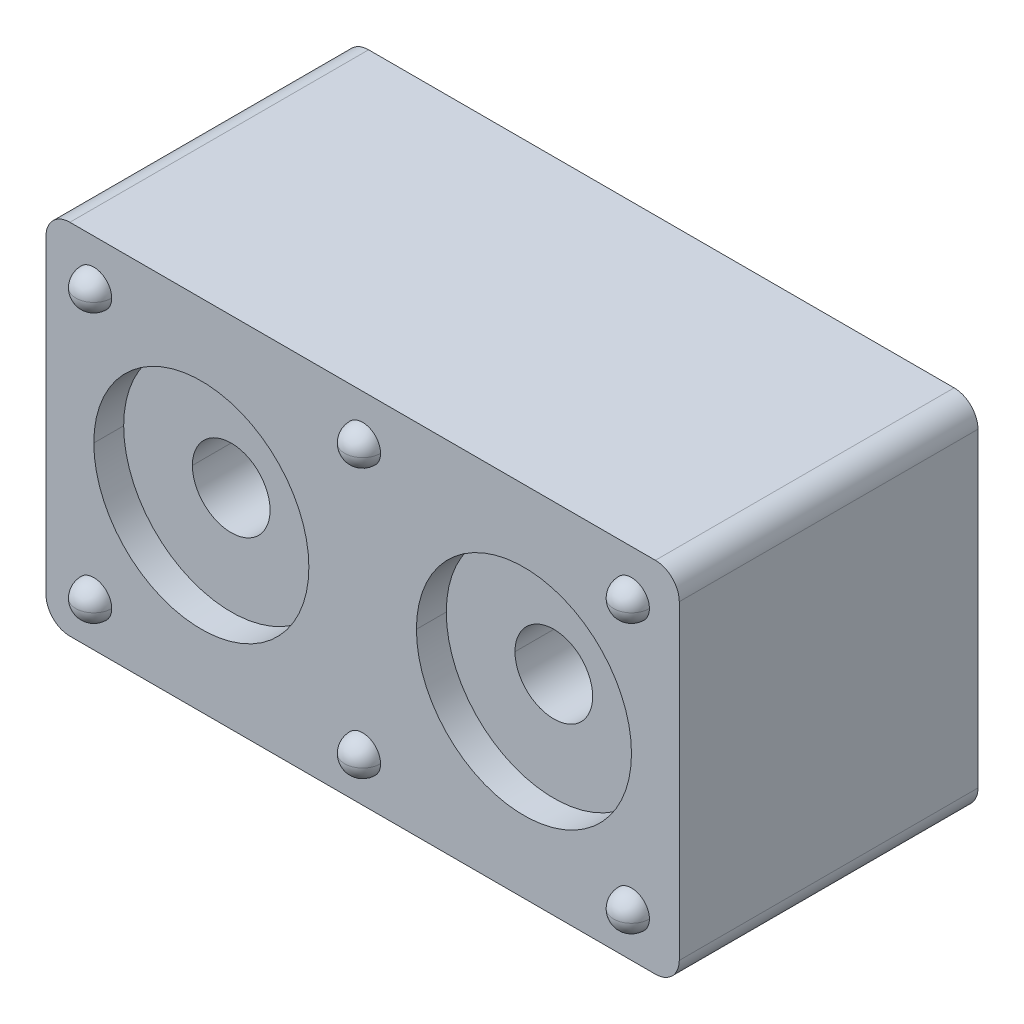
ISO-10303-21;
HEADER;
FILE_DESCRIPTION(('STEP AP214'),'2;1');
FILE_NAME('part.step','',(''),(''),'','','');
FILE_SCHEMA(('AUTOMOTIVE_DESIGN { 1 0 10303 214 1 1 1 1 }'));
ENDSEC;
DATA;
#1=APPLICATION_CONTEXT('core data for automotive mechanical design processes');
#2=APPLICATION_PROTOCOL_DEFINITION('international standard','automotive_design',2000,#1);
#3=PRODUCT_CONTEXT('',#1,'mechanical');
#4=PRODUCT('Part','Part','',(#3));
#5=PRODUCT_RELATED_PRODUCT_CATEGORY('part','',(#4));
#6=PRODUCT_DEFINITION_FORMATION('','',#4);
#7=PRODUCT_DEFINITION_CONTEXT('part definition',#1,'design');
#8=PRODUCT_DEFINITION('design','',#6,#7);
#9=PRODUCT_DEFINITION_SHAPE('','',#8);
#10=(LENGTH_UNIT() NAMED_UNIT(*) SI_UNIT(.MILLI.,.METRE.));
#11=(NAMED_UNIT(*) PLANE_ANGLE_UNIT() SI_UNIT($,.RADIAN.));
#12=(NAMED_UNIT(*) SI_UNIT($,.STERADIAN.) SOLID_ANGLE_UNIT());
#13=UNCERTAINTY_MEASURE_WITH_UNIT(LENGTH_MEASURE(1.E-05),#10,'distance_accuracy_value','');
#14=(GEOMETRIC_REPRESENTATION_CONTEXT(3) GLOBAL_UNCERTAINTY_ASSIGNED_CONTEXT((#13)) GLOBAL_UNIT_ASSIGNED_CONTEXT((#10,
#11,#12)) REPRESENTATION_CONTEXT('',''));
#15=CARTESIAN_POINT('',(0.,0.,0.));
#16=DIRECTION('',(0.,0.,1.));
#17=DIRECTION('',(1.,0.,0.));
#18=AXIS2_PLACEMENT_3D('',#15,#16,#17);
#19=CARTESIAN_POINT('',(-5.3,2.6,-7.8));
#20=DIRECTION('',(-1.,0.,0.));
#21=DIRECTION('',(0.,0.,1.));
#22=AXIS2_PLACEMENT_3D('',#19,#20,#21);
#23=PLANE('',#22);
#24=DIRECTION('',(0.,-1.,0.));
#25=VECTOR('',#24,1.);
#26=CARTESIAN_POINT('',(-5.3,2.6,-2.8));
#27=LINE('',#26,#25);
#28=CARTESIAN_POINT('',(-5.3,2.6,-2.8));
#29=VERTEX_POINT('',#28);
#30=CARTESIAN_POINT('',(-5.3,-2.6,-2.8));
#31=VERTEX_POINT('',#30);
#32=EDGE_CURVE('E11',#29,#31,#27,.T.);
#33=ORIENTED_EDGE('',*,*,#32,.F.);
#34=DIRECTION('',(0.,0.,1.));
#35=VECTOR('',#34,1.);
#36=CARTESIAN_POINT('',(-5.3,2.6,-7.8));
#37=LINE('',#36,#35);
#38=CARTESIAN_POINT('',(-5.3,2.6,-7.8));
#39=VERTEX_POINT('',#38);
#40=EDGE_CURVE('E24',#39,#29,#37,.T.);
#41=ORIENTED_EDGE('',*,*,#40,.F.);
#42=DIRECTION('',(0.,-1.,0.));
#43=VECTOR('',#42,1.);
#44=CARTESIAN_POINT('',(-5.3,2.6,-7.8));
#45=LINE('',#44,#43);
#46=CARTESIAN_POINT('',(-5.3,-2.6,-7.8));
#47=VERTEX_POINT('',#46);
#48=EDGE_CURVE('E749',#39,#47,#45,.T.);
#49=ORIENTED_EDGE('',*,*,#48,.T.);
#50=DIRECTION('',(0.,0.,1.));
#51=VECTOR('',#50,1.);
#52=CARTESIAN_POINT('',(-5.3,-2.6,-7.8));
#53=LINE('',#52,#51);
#54=EDGE_CURVE('E745',#47,#31,#53,.T.);
#55=ORIENTED_EDGE('',*,*,#54,.T.);
#56=EDGE_LOOP('',(#33,#41,#49,#55));
#57=FACE_BOUND('',#56,.T.);
#58=ADVANCED_FACE('F16',(#57),#23,.T.);
#59=CARTESIAN_POINT('',(-4.89999999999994,-2.59999999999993,-7.8));
#60=DIRECTION('',(0.,0.,1.));
#61=DIRECTION('',(0.707106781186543,0.707106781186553,0.));
#62=AXIS2_PLACEMENT_3D('',#59,#60,#61);
#63=CYLINDRICAL_SURFACE('',#62,0.400000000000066);
#64=CARTESIAN_POINT('',(-4.89999999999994,-2.59999999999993,-2.8));
#65=DIRECTION('',(0.,0.,1.));
#66=DIRECTION('',(1.,0.,0.));
#67=AXIS2_PLACEMENT_3D('',#64,#65,#66);
#68=CIRCLE('',#67,0.400000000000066);
#69=CARTESIAN_POINT('',(-4.9,-3.,-2.8));
#70=VERTEX_POINT('',#69);
#71=EDGE_CURVE('E740',#31,#70,#68,.T.);
#72=ORIENTED_EDGE('',*,*,#71,.F.);
#73=ORIENTED_EDGE('',*,*,#54,.F.);
#74=CARTESIAN_POINT('',(-4.89999999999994,-2.59999999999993,-7.8));
#75=DIRECTION('',(0.,0.,1.));
#76=DIRECTION('',(1.,0.,0.));
#77=AXIS2_PLACEMENT_3D('',#74,#75,#76);
#78=CIRCLE('',#77,0.400000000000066);
#79=CARTESIAN_POINT('',(-4.9,-3.,-7.8));
#80=VERTEX_POINT('',#79);
#81=EDGE_CURVE('E736',#47,#80,#78,.T.);
#82=ORIENTED_EDGE('',*,*,#81,.T.);
#83=DIRECTION('',(0.,0.,1.));
#84=VECTOR('',#83,1.);
#85=CARTESIAN_POINT('',(-4.9,-3.,-7.8));
#86=LINE('',#85,#84);
#87=EDGE_CURVE('E732',#80,#70,#86,.T.);
#88=ORIENTED_EDGE('',*,*,#87,.T.);
#89=EDGE_LOOP('',(#72,#73,#82,#88));
#90=FACE_BOUND('',#89,.T.);
#91=ADVANCED_FACE('F771',(#90),#63,.T.);
#92=CARTESIAN_POINT('',(-4.9,-3.,-7.8));
#93=DIRECTION('',(0.,-1.,0.));
#94=DIRECTION('',(0.,0.,-1.));
#95=AXIS2_PLACEMENT_3D('',#92,#93,#94);
#96=PLANE('',#95);
#97=DIRECTION('',(1.,0.,0.));
#98=VECTOR('',#97,1.);
#99=CARTESIAN_POINT('',(-4.9,-3.,-2.8));
#100=LINE('',#99,#98);
#101=CARTESIAN_POINT('',(4.9,-3.,-2.8));
#102=VERTEX_POINT('',#101);
#103=EDGE_CURVE('E727',#70,#102,#100,.T.);
#104=ORIENTED_EDGE('',*,*,#103,.F.);
#105=ORIENTED_EDGE('',*,*,#87,.F.);
#106=DIRECTION('',(1.,0.,0.));
#107=VECTOR('',#106,1.);
#108=CARTESIAN_POINT('',(-4.9,-3.,-7.8));
#109=LINE('',#108,#107);
#110=CARTESIAN_POINT('',(4.9,-3.,-7.8));
#111=VERTEX_POINT('',#110);
#112=EDGE_CURVE('E723',#80,#111,#109,.T.);
#113=ORIENTED_EDGE('',*,*,#112,.T.);
#114=DIRECTION('',(0.,0.,1.));
#115=VECTOR('',#114,1.);
#116=CARTESIAN_POINT('',(4.9,-3.,-7.8));
#117=LINE('',#116,#115);
#118=EDGE_CURVE('E719',#111,#102,#117,.T.);
#119=ORIENTED_EDGE('',*,*,#118,.T.);
#120=EDGE_LOOP('',(#104,#105,#113,#119));
#121=FACE_BOUND('',#120,.T.);
#122=ADVANCED_FACE('F796',(#121),#96,.T.);
#123=CARTESIAN_POINT('',(4.89999999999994,-2.59999999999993,-7.8));
#124=DIRECTION('',(0.,0.,1.));
#125=DIRECTION('',(-0.7071067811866,0.707106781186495,0.));
#126=AXIS2_PLACEMENT_3D('',#123,#124,#125);
#127=CYLINDRICAL_SURFACE('',#126,0.400000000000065);
#128=CARTESIAN_POINT('',(4.89999999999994,-2.59999999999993,-2.8));
#129=DIRECTION('',(0.,0.,1.));
#130=DIRECTION('',(1.,0.,0.));
#131=AXIS2_PLACEMENT_3D('',#128,#129,#130);
#132=CIRCLE('',#131,0.400000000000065);
#133=CARTESIAN_POINT('',(5.3,-2.6,-2.8));
#134=VERTEX_POINT('',#133);
#135=EDGE_CURVE('E714',#102,#134,#132,.T.);
#136=ORIENTED_EDGE('',*,*,#135,.F.);
#137=ORIENTED_EDGE('',*,*,#118,.F.);
#138=CARTESIAN_POINT('',(4.89999999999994,-2.59999999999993,-7.8));
#139=DIRECTION('',(0.,0.,1.));
#140=DIRECTION('',(1.,0.,0.));
#141=AXIS2_PLACEMENT_3D('',#138,#139,#140);
#142=CIRCLE('',#141,0.400000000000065);
#143=CARTESIAN_POINT('',(5.3,-2.6,-7.8));
#144=VERTEX_POINT('',#143);
#145=EDGE_CURVE('E710',#111,#144,#142,.T.);
#146=ORIENTED_EDGE('',*,*,#145,.T.);
#147=DIRECTION('',(0.,0.,1.));
#148=VECTOR('',#147,1.);
#149=CARTESIAN_POINT('',(5.3,-2.6,-7.8));
#150=LINE('',#149,#148);
#151=EDGE_CURVE('E706',#144,#134,#150,.T.);
#152=ORIENTED_EDGE('',*,*,#151,.T.);
#153=EDGE_LOOP('',(#136,#137,#146,#152));
#154=FACE_BOUND('',#153,.T.);
#155=ADVANCED_FACE('F793',(#154),#127,.T.);
#156=CARTESIAN_POINT('',(5.3,-2.6,-7.8));
#157=DIRECTION('',(1.,0.,0.));
#158=DIRECTION('',(0.,0.,-1.));
#159=AXIS2_PLACEMENT_3D('',#156,#157,#158);
#160=PLANE('',#159);
#161=DIRECTION('',(0.,1.,0.));
#162=VECTOR('',#161,1.);
#163=CARTESIAN_POINT('',(5.3,-2.6,-2.8));
#164=LINE('',#163,#162);
#165=CARTESIAN_POINT('',(5.3,2.6,-2.8));
#166=VERTEX_POINT('',#165);
#167=EDGE_CURVE('E701',#134,#166,#164,.T.);
#168=ORIENTED_EDGE('',*,*,#167,.F.);
#169=ORIENTED_EDGE('',*,*,#151,.F.);
#170=DIRECTION('',(0.,1.,0.));
#171=VECTOR('',#170,1.);
#172=CARTESIAN_POINT('',(5.3,-2.6,-7.8));
#173=LINE('',#172,#171);
#174=CARTESIAN_POINT('',(5.3,2.6,-7.8));
#175=VERTEX_POINT('',#174);
#176=EDGE_CURVE('E697',#144,#175,#173,.T.);
#177=ORIENTED_EDGE('',*,*,#176,.T.);
#178=DIRECTION('',(0.,0.,1.));
#179=VECTOR('',#178,1.);
#180=CARTESIAN_POINT('',(5.3,2.6,-7.8));
#181=LINE('',#180,#179);
#182=EDGE_CURVE('E693',#175,#166,#181,.T.);
#183=ORIENTED_EDGE('',*,*,#182,.T.);
#184=EDGE_LOOP('',(#168,#169,#177,#183));
#185=FACE_BOUND('',#184,.T.);
#186=ADVANCED_FACE('F790',(#185),#160,.T.);
#187=CARTESIAN_POINT('',(4.89999999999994,2.59999999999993,-7.8));
#188=DIRECTION('',(0.,0.,1.));
#189=DIRECTION('',(-0.707106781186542,-0.707106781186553,0.));
#190=AXIS2_PLACEMENT_3D('',#187,#188,#189);
#191=CYLINDRICAL_SURFACE('',#190,0.400000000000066);
#192=CARTESIAN_POINT('',(4.89999999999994,2.59999999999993,-2.8));
#193=DIRECTION('',(0.,0.,1.));
#194=DIRECTION('',(1.,0.,0.));
#195=AXIS2_PLACEMENT_3D('',#192,#193,#194);
#196=CIRCLE('',#195,0.400000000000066);
#197=CARTESIAN_POINT('',(4.9,3.,-2.8));
#198=VERTEX_POINT('',#197);
#199=EDGE_CURVE('E688',#166,#198,#196,.T.);
#200=ORIENTED_EDGE('',*,*,#199,.F.);
#201=ORIENTED_EDGE('',*,*,#182,.F.);
#202=CARTESIAN_POINT('',(4.89999999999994,2.59999999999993,-7.8));
#203=DIRECTION('',(0.,0.,1.));
#204=DIRECTION('',(1.,0.,0.));
#205=AXIS2_PLACEMENT_3D('',#202,#203,#204);
#206=CIRCLE('',#205,0.400000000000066);
#207=CARTESIAN_POINT('',(4.9,3.,-7.8));
#208=VERTEX_POINT('',#207);
#209=EDGE_CURVE('E684',#175,#208,#206,.T.);
#210=ORIENTED_EDGE('',*,*,#209,.T.);
#211=DIRECTION('',(0.,0.,1.));
#212=VECTOR('',#211,1.);
#213=CARTESIAN_POINT('',(4.9,3.,-7.8));
#214=LINE('',#213,#212);
#215=EDGE_CURVE('E680',#208,#198,#214,.T.);
#216=ORIENTED_EDGE('',*,*,#215,.T.);
#217=EDGE_LOOP('',(#200,#201,#210,#216));
#218=FACE_BOUND('',#217,.T.);
#219=ADVANCED_FACE('F787',(#218),#191,.T.);
#220=CARTESIAN_POINT('',(4.9,3.,-7.8));
#221=DIRECTION('',(0.,1.,0.));
#222=DIRECTION('',(0.,0.,1.));
#223=AXIS2_PLACEMENT_3D('',#220,#221,#222);
#224=PLANE('',#223);
#225=DIRECTION('',(-1.,0.,0.));
#226=VECTOR('',#225,1.);
#227=CARTESIAN_POINT('',(4.9,3.,-2.8));
#228=LINE('',#227,#226);
#229=CARTESIAN_POINT('',(-4.9,3.,-2.8));
#230=VERTEX_POINT('',#229);
#231=EDGE_CURVE('E675',#198,#230,#228,.T.);
#232=ORIENTED_EDGE('',*,*,#231,.F.);
#233=ORIENTED_EDGE('',*,*,#215,.F.);
#234=DIRECTION('',(-1.,0.,0.));
#235=VECTOR('',#234,1.);
#236=CARTESIAN_POINT('',(4.9,3.,-7.8));
#237=LINE('',#236,#235);
#238=CARTESIAN_POINT('',(-4.9,3.,-7.8));
#239=VERTEX_POINT('',#238);
#240=EDGE_CURVE('E671',#208,#239,#237,.T.);
#241=ORIENTED_EDGE('',*,*,#240,.T.);
#242=DIRECTION('',(0.,0.,1.));
#243=VECTOR('',#242,1.);
#244=CARTESIAN_POINT('',(-4.9,3.,-7.8));
#245=LINE('',#244,#243);
#246=EDGE_CURVE('E667',#239,#230,#245,.T.);
#247=ORIENTED_EDGE('',*,*,#246,.T.);
#248=EDGE_LOOP('',(#232,#233,#241,#247));
#249=FACE_BOUND('',#248,.T.);
#250=ADVANCED_FACE('F780',(#249),#224,.T.);
#251=CARTESIAN_POINT('',(-4.89999999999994,2.59999999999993,-7.8));
#252=DIRECTION('',(0.,0.,1.));
#253=DIRECTION('',(0.707106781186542,-0.707106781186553,0.));
#254=AXIS2_PLACEMENT_3D('',#251,#252,#253);
#255=CYLINDRICAL_SURFACE('',#254,0.400000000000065);
#256=CARTESIAN_POINT('',(-4.89999999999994,2.59999999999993,-2.8));
#257=DIRECTION('',(0.,0.,1.));
#258=DIRECTION('',(1.,0.,0.));
#259=AXIS2_PLACEMENT_3D('',#256,#257,#258);
#260=CIRCLE('',#259,0.400000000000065);
#261=EDGE_CURVE('E663',#230,#29,#260,.T.);
#262=ORIENTED_EDGE('',*,*,#261,.F.);
#263=ORIENTED_EDGE('',*,*,#246,.F.);
#264=CARTESIAN_POINT('',(-4.89999999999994,2.59999999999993,-7.8));
#265=DIRECTION('',(0.,0.,1.));
#266=DIRECTION('',(1.,0.,0.));
#267=AXIS2_PLACEMENT_3D('',#264,#265,#266);
#268=CIRCLE('',#267,0.400000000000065);
#269=EDGE_CURVE('E659',#239,#39,#268,.T.);
#270=ORIENTED_EDGE('',*,*,#269,.T.);
#271=ORIENTED_EDGE('',*,*,#40,.T.);
#272=EDGE_LOOP('',(#262,#263,#270,#271));
#273=FACE_BOUND('',#272,.T.);
#274=ADVANCED_FACE('F759',(#273),#255,.T.);
#275=CARTESIAN_POINT('',(-4.89999999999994,-2.59999999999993,-7.8));
#276=DIRECTION('',(0.,0.,1.));
#277=DIRECTION('',(1.,0.,0.));
#278=AXIS2_PLACEMENT_3D('',#275,#276,#277);
#279=PLANE('',#278);
#280=CARTESIAN_POINT('',(4.5,2.25,-7.8));
#281=DIRECTION('',(0.,0.,-1.));
#282=DIRECTION('',(1.,0.,0.));
#283=AXIS2_PLACEMENT_3D('',#280,#281,#282);
#284=CIRCLE('',#283,0.3);
#285=CARTESIAN_POINT('',(4.20000000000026,2.25,-7.8));
#286=VERTEX_POINT('',#285);
#287=CARTESIAN_POINT('',(4.8,2.25,-7.8));
#288=VERTEX_POINT('',#287);
#289=EDGE_CURVE('E267',#286,#288,#284,.T.);
#290=ORIENTED_EDGE('',*,*,#289,.F.);
#291=CARTESIAN_POINT('',(4.5,2.25,-7.8));
#292=DIRECTION('',(0.,0.,-1.));
#293=DIRECTION('',(1.,0.,0.));
#294=AXIS2_PLACEMENT_3D('',#291,#292,#293);
#295=CIRCLE('',#294,0.3);
#296=EDGE_CURVE('E262',#288,#286,#295,.T.);
#297=ORIENTED_EDGE('',*,*,#296,.F.);
#298=EDGE_LOOP('',(#290,#297));
#299=FACE_BOUND('',#298,.T.);
#300=CARTESIAN_POINT('',(-4.5,2.25,-7.8));
#301=DIRECTION('',(0.,0.,-1.));
#302=DIRECTION('',(1.,0.,0.));
#303=AXIS2_PLACEMENT_3D('',#300,#301,#302);
#304=CIRCLE('',#303,0.3);
#305=CARTESIAN_POINT('',(-4.79999999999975,2.25,-7.8));
#306=VERTEX_POINT('',#305);
#307=CARTESIAN_POINT('',(-4.2,2.25,-7.8));
#308=VERTEX_POINT('',#307);
#309=EDGE_CURVE('E648',#306,#308,#304,.T.);
#310=ORIENTED_EDGE('',*,*,#309,.F.);
#311=CARTESIAN_POINT('',(-4.5,2.25,-7.8));
#312=DIRECTION('',(0.,0.,-1.));
#313=DIRECTION('',(1.,0.,0.));
#314=AXIS2_PLACEMENT_3D('',#311,#312,#313);
#315=CIRCLE('',#314,0.3);
#316=EDGE_CURVE('E643',#308,#306,#315,.T.);
#317=ORIENTED_EDGE('',*,*,#316,.F.);
#318=EDGE_LOOP('',(#310,#317));
#319=FACE_BOUND('',#318,.T.);
#320=CARTESIAN_POINT('',(0.,2.25,-7.8));
#321=DIRECTION('',(0.,0.,-1.));
#322=DIRECTION('',(1.,0.,0.));
#323=AXIS2_PLACEMENT_3D('',#320,#321,#322);
#324=CIRCLE('',#323,0.3);
#325=CARTESIAN_POINT('',(-0.29999999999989,2.25,-7.8));
#326=VERTEX_POINT('',#325);
#327=CARTESIAN_POINT('',(0.3,2.25,-7.8));
#328=VERTEX_POINT('',#327);
#329=EDGE_CURVE('E638',#326,#328,#324,.T.);
#330=ORIENTED_EDGE('',*,*,#329,.F.);
#331=CARTESIAN_POINT('',(0.,2.25,-7.8));
#332=DIRECTION('',(0.,0.,-1.));
#333=DIRECTION('',(1.,0.,0.));
#334=AXIS2_PLACEMENT_3D('',#331,#332,#333);
#335=CIRCLE('',#334,0.3);
#336=EDGE_CURVE('E633',#328,#326,#335,.T.);
#337=ORIENTED_EDGE('',*,*,#336,.F.);
#338=EDGE_LOOP('',(#330,#337));
#339=FACE_BOUND('',#338,.T.);
#340=CARTESIAN_POINT('',(4.5,-2.25,-7.8));
#341=DIRECTION('',(0.,0.,-1.));
#342=DIRECTION('',(1.,0.,0.));
#343=AXIS2_PLACEMENT_3D('',#340,#341,#342);
#344=CIRCLE('',#343,0.3);
#345=CARTESIAN_POINT('',(4.20000000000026,-2.25,-7.8));
#346=VERTEX_POINT('',#345);
#347=CARTESIAN_POINT('',(4.8,-2.25,-7.8));
#348=VERTEX_POINT('',#347);
#349=EDGE_CURVE('E628',#346,#348,#344,.T.);
#350=ORIENTED_EDGE('',*,*,#349,.F.);
#351=CARTESIAN_POINT('',(4.5,-2.25,-7.8));
#352=DIRECTION('',(0.,0.,-1.));
#353=DIRECTION('',(1.,0.,0.));
#354=AXIS2_PLACEMENT_3D('',#351,#352,#353);
#355=CIRCLE('',#354,0.3);
#356=EDGE_CURVE('E623',#348,#346,#355,.T.);
#357=ORIENTED_EDGE('',*,*,#356,.F.);
#358=EDGE_LOOP('',(#350,#357));
#359=FACE_BOUND('',#358,.T.);
#360=CARTESIAN_POINT('',(0.,-2.25,-7.8));
#361=DIRECTION('',(0.,0.,-1.));
#362=DIRECTION('',(1.,0.,0.));
#363=AXIS2_PLACEMENT_3D('',#360,#361,#362);
#364=CIRCLE('',#363,0.3);
#365=CARTESIAN_POINT('',(-0.29999999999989,-2.25,-7.8));
#366=VERTEX_POINT('',#365);
#367=CARTESIAN_POINT('',(0.3,-2.25,-7.8));
#368=VERTEX_POINT('',#367);
#369=EDGE_CURVE('E618',#366,#368,#364,.T.);
#370=ORIENTED_EDGE('',*,*,#369,.F.);
#371=CARTESIAN_POINT('',(0.,-2.25,-7.8));
#372=DIRECTION('',(0.,0.,-1.));
#373=DIRECTION('',(1.,0.,0.));
#374=AXIS2_PLACEMENT_3D('',#371,#372,#373);
#375=CIRCLE('',#374,0.3);
#376=EDGE_CURVE('E613',#368,#366,#375,.T.);
#377=ORIENTED_EDGE('',*,*,#376,.F.);
#378=EDGE_LOOP('',(#370,#377));
#379=FACE_BOUND('',#378,.T.);
#380=CARTESIAN_POINT('',(-4.5,-2.25,-7.8));
#381=DIRECTION('',(0.,0.,-1.));
#382=DIRECTION('',(1.,0.,0.));
#383=AXIS2_PLACEMENT_3D('',#380,#381,#382);
#384=CIRCLE('',#383,0.3);
#385=CARTESIAN_POINT('',(-4.79999999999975,-2.25,-7.8));
#386=VERTEX_POINT('',#385);
#387=CARTESIAN_POINT('',(-4.2,-2.25,-7.8));
#388=VERTEX_POINT('',#387);
#389=EDGE_CURVE('E608',#386,#388,#384,.T.);
#390=ORIENTED_EDGE('',*,*,#389,.F.);
#391=CARTESIAN_POINT('',(-4.5,-2.25,-7.8));
#392=DIRECTION('',(0.,0.,-1.));
#393=DIRECTION('',(1.,0.,0.));
#394=AXIS2_PLACEMENT_3D('',#391,#392,#393);
#395=CIRCLE('',#394,0.3);
#396=EDGE_CURVE('E603',#388,#386,#395,.T.);
#397=ORIENTED_EDGE('',*,*,#396,.F.);
#398=EDGE_LOOP('',(#390,#397));
#399=FACE_BOUND('',#398,.T.);
#400=CARTESIAN_POINT('',(2.7,0.,-7.8));
#401=DIRECTION('',(0.,0.,1.));
#402=DIRECTION('',(1.,0.,0.));
#403=AXIS2_PLACEMENT_3D('',#400,#401,#402);
#404=CIRCLE('',#403,1.8);
#405=CARTESIAN_POINT('',(4.5,0.,-7.8));
#406=VERTEX_POINT('',#405);
#407=CARTESIAN_POINT('',(0.9,0.,-7.8));
#408=VERTEX_POINT('',#407);
#409=EDGE_CURVE('E599',#406,#408,#404,.T.);
#410=ORIENTED_EDGE('',*,*,#409,.T.);
#411=CARTESIAN_POINT('',(2.7,0.,-7.8));
#412=DIRECTION('',(0.,0.,1.));
#413=DIRECTION('',(1.,0.,0.));
#414=AXIS2_PLACEMENT_3D('',#411,#412,#413);
#415=CIRCLE('',#414,1.8);
#416=EDGE_CURVE('E595',#408,#406,#415,.T.);
#417=ORIENTED_EDGE('',*,*,#416,.T.);
#418=EDGE_LOOP('',(#410,#417));
#419=FACE_BOUND('',#418,.T.);
#420=CARTESIAN_POINT('',(-2.7,0.,-7.8));
#421=DIRECTION('',(0.,0.,1.));
#422=DIRECTION('',(1.,0.,0.));
#423=AXIS2_PLACEMENT_3D('',#420,#421,#422);
#424=CIRCLE('',#423,1.8);
#425=CARTESIAN_POINT('',(-0.9,0.,-7.8));
#426=VERTEX_POINT('',#425);
#427=CARTESIAN_POINT('',(-4.5,0.,-7.8));
#428=VERTEX_POINT('',#427);
#429=EDGE_CURVE('E591',#426,#428,#424,.T.);
#430=ORIENTED_EDGE('',*,*,#429,.T.);
#431=CARTESIAN_POINT('',(-2.7,0.,-7.8));
#432=DIRECTION('',(0.,0.,1.));
#433=DIRECTION('',(1.,0.,0.));
#434=AXIS2_PLACEMENT_3D('',#431,#432,#433);
#435=CIRCLE('',#434,1.8);
#436=EDGE_CURVE('E587',#428,#426,#435,.T.);
#437=ORIENTED_EDGE('',*,*,#436,.T.);
#438=EDGE_LOOP('',(#430,#437));
#439=FACE_BOUND('',#438,.T.);
#440=ORIENTED_EDGE('',*,*,#48,.F.);
#441=ORIENTED_EDGE('',*,*,#269,.F.);
#442=ORIENTED_EDGE('',*,*,#240,.F.);
#443=ORIENTED_EDGE('',*,*,#209,.F.);
#444=ORIENTED_EDGE('',*,*,#176,.F.);
#445=ORIENTED_EDGE('',*,*,#145,.F.);
#446=ORIENTED_EDGE('',*,*,#112,.F.);
#447=ORIENTED_EDGE('',*,*,#81,.F.);
#448=EDGE_LOOP('',(#440,#441,#442,#443,#444,#445,#446,#447));
#449=FACE_BOUND('',#448,.T.);
#450=ADVANCED_FACE('F766',(#299,#319,#339,#359,#379,#399,#419,#439,#449),#279,.F.);
#451=CARTESIAN_POINT('',(-2.7,0.,-2.8));
#452=DIRECTION('',(0.,0.,1.));
#453=DIRECTION('',(0.,1.,0.));
#454=AXIS2_PLACEMENT_3D('',#451,#452,#453);
#455=CYLINDRICAL_SURFACE('',#454,1.8);
#456=DIRECTION('',(0.,0.,1.));
#457=VECTOR('',#456,1.);
#458=CARTESIAN_POINT('',(-4.5,0.,-7.8));
#459=LINE('',#458,#457);
#460=CARTESIAN_POINT('',(-4.5,0.,-7.3));
#461=VERTEX_POINT('',#460);
#462=EDGE_CURVE('E583',#428,#461,#459,.T.);
#463=ORIENTED_EDGE('',*,*,#462,.T.);
#464=CARTESIAN_POINT('',(-2.7,0.,-7.3));
#465=DIRECTION('',(0.,0.,1.));
#466=DIRECTION('',(1.,0.,0.));
#467=AXIS2_PLACEMENT_3D('',#464,#465,#466);
#468=CIRCLE('',#467,1.8);
#469=CARTESIAN_POINT('',(-0.9,0.,-7.3));
#470=VERTEX_POINT('',#469);
#471=EDGE_CURVE('E579',#461,#470,#468,.T.);
#472=ORIENTED_EDGE('',*,*,#471,.T.);
#473=DIRECTION('',(0.,0.,1.));
#474=VECTOR('',#473,1.);
#475=CARTESIAN_POINT('',(-0.9,0.,-7.8));
#476=LINE('',#475,#474);
#477=EDGE_CURVE('E574',#426,#470,#476,.T.);
#478=ORIENTED_EDGE('',*,*,#477,.F.);
#479=ORIENTED_EDGE('',*,*,#436,.F.);
#480=EDGE_LOOP('',(#463,#472,#478,#479));
#481=FACE_BOUND('',#480,.T.);
#482=ADVANCED_FACE('F876',(#481),#455,.F.);
#483=CARTESIAN_POINT('',(-2.7,0.,-2.8));
#484=DIRECTION('',(0.,0.,1.));
#485=DIRECTION('',(0.,-1.,0.));
#486=AXIS2_PLACEMENT_3D('',#483,#484,#485);
#487=CYLINDRICAL_SURFACE('',#486,1.8);
#488=ORIENTED_EDGE('',*,*,#462,.F.);
#489=ORIENTED_EDGE('',*,*,#429,.F.);
#490=ORIENTED_EDGE('',*,*,#477,.T.);
#491=CARTESIAN_POINT('',(-2.7,0.,-7.3));
#492=DIRECTION('',(0.,0.,1.));
#493=DIRECTION('',(1.,0.,0.));
#494=AXIS2_PLACEMENT_3D('',#491,#492,#493);
#495=CIRCLE('',#494,1.8);
#496=EDGE_CURVE('E569',#470,#461,#495,.T.);
#497=ORIENTED_EDGE('',*,*,#496,.T.);
#498=EDGE_LOOP('',(#488,#489,#490,#497));
#499=FACE_BOUND('',#498,.T.);
#500=ADVANCED_FACE('F887',(#499),#487,.F.);
#501=CARTESIAN_POINT('',(-0.9,0.,-7.3));
#502=DIRECTION('',(0.,0.,-1.));
#503=DIRECTION('',(-1.,0.,0.));
#504=AXIS2_PLACEMENT_3D('',#501,#502,#503);
#505=PLANE('',#504);
#506=CARTESIAN_POINT('',(-2.7,0.,-7.3));
#507=DIRECTION('',(0.,0.,1.));
#508=DIRECTION('',(1.,0.,0.));
#509=AXIS2_PLACEMENT_3D('',#506,#507,#508);
#510=CIRCLE('',#509,0.65);
#511=CARTESIAN_POINT('',(-2.05,0.,-7.3));
#512=VERTEX_POINT('',#511);
#513=CARTESIAN_POINT('',(-3.35,0.,-7.3));
#514=VERTEX_POINT('',#513);
#515=EDGE_CURVE('E565',#512,#514,#510,.T.);
#516=ORIENTED_EDGE('',*,*,#515,.T.);
#517=CARTESIAN_POINT('',(-2.7,0.,-7.3));
#518=DIRECTION('',(0.,0.,1.));
#519=DIRECTION('',(1.,0.,0.));
#520=AXIS2_PLACEMENT_3D('',#517,#518,#519);
#521=CIRCLE('',#520,0.65);
#522=EDGE_CURVE('E561',#514,#512,#521,.T.);
#523=ORIENTED_EDGE('',*,*,#522,.T.);
#524=EDGE_LOOP('',(#516,#523));
#525=FACE_BOUND('',#524,.T.);
#526=ORIENTED_EDGE('',*,*,#471,.F.);
#527=ORIENTED_EDGE('',*,*,#496,.F.);
#528=EDGE_LOOP('',(#526,#527));
#529=FACE_BOUND('',#528,.T.);
#530=ADVANCED_FACE('F898',(#525,#529),#505,.T.);
#531=CARTESIAN_POINT('',(-2.7,0.,-2.8));
#532=DIRECTION('',(0.,0.,1.));
#533=DIRECTION('',(0.,1.,0.));
#534=AXIS2_PLACEMENT_3D('',#531,#532,#533);
#535=CYLINDRICAL_SURFACE('',#534,0.65);
#536=DIRECTION('',(0.,0.,1.));
#537=VECTOR('',#536,1.);
#538=CARTESIAN_POINT('',(-3.35,0.,-7.3));
#539=LINE('',#538,#537);
#540=CARTESIAN_POINT('',(-3.35,0.,-3.3));
#541=VERTEX_POINT('',#540);
#542=EDGE_CURVE('E557',#514,#541,#539,.T.);
#543=ORIENTED_EDGE('',*,*,#542,.T.);
#544=CARTESIAN_POINT('',(-2.7,0.,-3.3));
#545=DIRECTION('',(0.,0.,1.));
#546=DIRECTION('',(1.,0.,0.));
#547=AXIS2_PLACEMENT_3D('',#544,#545,#546);
#548=CIRCLE('',#547,0.65);
#549=CARTESIAN_POINT('',(-2.05,0.,-3.3));
#550=VERTEX_POINT('',#549);
#551=EDGE_CURVE('E553',#541,#550,#548,.T.);
#552=ORIENTED_EDGE('',*,*,#551,.T.);
#553=DIRECTION('',(0.,0.,1.));
#554=VECTOR('',#553,1.);
#555=CARTESIAN_POINT('',(-2.05,0.,-7.3));
#556=LINE('',#555,#554);
#557=EDGE_CURVE('E548',#512,#550,#556,.T.);
#558=ORIENTED_EDGE('',*,*,#557,.F.);
#559=ORIENTED_EDGE('',*,*,#522,.F.);
#560=EDGE_LOOP('',(#543,#552,#558,#559));
#561=FACE_BOUND('',#560,.T.);
#562=ADVANCED_FACE('F909',(#561),#535,.F.);
#563=CARTESIAN_POINT('',(-2.7,0.,-2.8));
#564=DIRECTION('',(0.,0.,1.));
#565=DIRECTION('',(0.,-1.,0.));
#566=AXIS2_PLACEMENT_3D('',#563,#564,#565);
#567=CYLINDRICAL_SURFACE('',#566,0.65);
#568=ORIENTED_EDGE('',*,*,#542,.F.);
#569=ORIENTED_EDGE('',*,*,#515,.F.);
#570=ORIENTED_EDGE('',*,*,#557,.T.);
#571=CARTESIAN_POINT('',(-2.7,0.,-3.3));
#572=DIRECTION('',(0.,0.,1.));
#573=DIRECTION('',(1.,0.,0.));
#574=AXIS2_PLACEMENT_3D('',#571,#572,#573);
#575=CIRCLE('',#574,0.65);
#576=EDGE_CURVE('E543',#550,#541,#575,.T.);
#577=ORIENTED_EDGE('',*,*,#576,.T.);
#578=EDGE_LOOP('',(#568,#569,#570,#577));
#579=FACE_BOUND('',#578,.T.);
#580=ADVANCED_FACE('F920',(#579),#567,.F.);
#581=CARTESIAN_POINT('',(-2.05,0.,-3.3));
#582=DIRECTION('',(0.,0.,1.));
#583=DIRECTION('',(1.,0.,0.));
#584=AXIS2_PLACEMENT_3D('',#581,#582,#583);
#585=PLANE('',#584);
#586=CARTESIAN_POINT('',(-2.7,0.,-3.3));
#587=DIRECTION('',(0.,0.,1.));
#588=DIRECTION('',(1.,0.,0.));
#589=AXIS2_PLACEMENT_3D('',#586,#587,#588);
#590=CIRCLE('',#589,1.8);
#591=CARTESIAN_POINT('',(-0.9,0.,-3.3));
#592=VERTEX_POINT('',#591);
#593=CARTESIAN_POINT('',(-4.5,0.,-3.3));
#594=VERTEX_POINT('',#593);
#595=EDGE_CURVE('E539',#592,#594,#590,.T.);
#596=ORIENTED_EDGE('',*,*,#595,.T.);
#597=CARTESIAN_POINT('',(-2.7,0.,-3.3));
#598=DIRECTION('',(0.,0.,1.));
#599=DIRECTION('',(1.,0.,0.));
#600=AXIS2_PLACEMENT_3D('',#597,#598,#599);
#601=CIRCLE('',#600,1.8);
#602=EDGE_CURVE('E535',#594,#592,#601,.T.);
#603=ORIENTED_EDGE('',*,*,#602,.T.);
#604=EDGE_LOOP('',(#596,#603));
#605=FACE_BOUND('',#604,.T.);
#606=ORIENTED_EDGE('',*,*,#551,.F.);
#607=ORIENTED_EDGE('',*,*,#576,.F.);
#608=EDGE_LOOP('',(#606,#607));
#609=FACE_BOUND('',#608,.T.);
#610=ADVANCED_FACE('F931',(#605,#609),#585,.T.);
#611=CARTESIAN_POINT('',(-2.7,0.,-2.8));
#612=DIRECTION('',(0.,0.,1.));
#613=DIRECTION('',(0.,1.,0.));
#614=AXIS2_PLACEMENT_3D('',#611,#612,#613);
#615=CYLINDRICAL_SURFACE('',#614,1.8);
#616=DIRECTION('',(0.,0.,1.));
#617=VECTOR('',#616,1.);
#618=CARTESIAN_POINT('',(-4.5,0.,-3.3));
#619=LINE('',#618,#617);
#620=CARTESIAN_POINT('',(-4.5,0.,-2.8));
#621=VERTEX_POINT('',#620);
#622=EDGE_CURVE('E531',#594,#621,#619,.T.);
#623=ORIENTED_EDGE('',*,*,#622,.T.);
#624=CARTESIAN_POINT('',(-2.7,0.,-2.8));
#625=DIRECTION('',(0.,0.,1.));
#626=DIRECTION('',(1.,0.,0.));
#627=AXIS2_PLACEMENT_3D('',#624,#625,#626);
#628=CIRCLE('',#627,1.8);
#629=CARTESIAN_POINT('',(-0.9,0.,-2.8));
#630=VERTEX_POINT('',#629);
#631=EDGE_CURVE('E527',#621,#630,#628,.T.);
#632=ORIENTED_EDGE('',*,*,#631,.T.);
#633=DIRECTION('',(0.,0.,1.));
#634=VECTOR('',#633,1.);
#635=CARTESIAN_POINT('',(-0.9,0.,-3.3));
#636=LINE('',#635,#634);
#637=EDGE_CURVE('E522',#592,#630,#636,.T.);
#638=ORIENTED_EDGE('',*,*,#637,.F.);
#639=ORIENTED_EDGE('',*,*,#602,.F.);
#640=EDGE_LOOP('',(#623,#632,#638,#639));
#641=FACE_BOUND('',#640,.T.);
#642=ADVANCED_FACE('F942',(#641),#615,.F.);
#643=CARTESIAN_POINT('',(-2.7,0.,-2.8));
#644=DIRECTION('',(0.,0.,1.));
#645=DIRECTION('',(0.,-1.,0.));
#646=AXIS2_PLACEMENT_3D('',#643,#644,#645);
#647=CYLINDRICAL_SURFACE('',#646,1.8);
#648=ORIENTED_EDGE('',*,*,#622,.F.);
#649=ORIENTED_EDGE('',*,*,#595,.F.);
#650=ORIENTED_EDGE('',*,*,#637,.T.);
#651=CARTESIAN_POINT('',(-2.7,0.,-2.8));
#652=DIRECTION('',(0.,0.,1.));
#653=DIRECTION('',(1.,0.,0.));
#654=AXIS2_PLACEMENT_3D('',#651,#652,#653);
#655=CIRCLE('',#654,1.8);
#656=EDGE_CURVE('E517',#630,#621,#655,.T.);
#657=ORIENTED_EDGE('',*,*,#656,.T.);
#658=EDGE_LOOP('',(#648,#649,#650,#657));
#659=FACE_BOUND('',#658,.T.);
#660=ADVANCED_FACE('F953',(#659),#647,.F.);
#661=CARTESIAN_POINT('',(-4.89999999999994,-2.59999999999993,-2.8));
#662=DIRECTION('',(0.,0.,1.));
#663=DIRECTION('',(1.,0.,0.));
#664=AXIS2_PLACEMENT_3D('',#661,#662,#663);
#665=PLANE('',#664);
#666=CARTESIAN_POINT('',(4.50000000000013,2.25,-2.8));
#667=DIRECTION('',(0.,0.,1.));
#668=DIRECTION('',(1.,0.,0.));
#669=AXIS2_PLACEMENT_3D('',#666,#667,#668);
#670=CIRCLE('',#669,0.299999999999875);
#671=CARTESIAN_POINT('',(4.20000000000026,2.25,-2.8));
#672=VERTEX_POINT('',#671);
#673=CARTESIAN_POINT('',(4.8,2.25,-2.8));
#674=VERTEX_POINT('',#673);
#675=EDGE_CURVE('E512',#672,#674,#670,.T.);
#676=ORIENTED_EDGE('',*,*,#675,.F.);
#677=CARTESIAN_POINT('',(4.50000000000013,2.25,-2.8));
#678=DIRECTION('',(0.,0.,1.));
#679=DIRECTION('',(1.,0.,0.));
#680=AXIS2_PLACEMENT_3D('',#677,#678,#679);
#681=CIRCLE('',#680,0.299999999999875);
#682=EDGE_CURVE('E507',#674,#672,#681,.T.);
#683=ORIENTED_EDGE('',*,*,#682,.F.);
#684=EDGE_LOOP('',(#676,#683));
#685=FACE_BOUND('',#684,.T.);
#686=CARTESIAN_POINT('',(-4.49999999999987,2.25,-2.8));
#687=DIRECTION('',(0.,0.,1.));
#688=DIRECTION('',(1.,0.,0.));
#689=AXIS2_PLACEMENT_3D('',#686,#687,#688);
#690=CIRCLE('',#689,0.299999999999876);
#691=CARTESIAN_POINT('',(-4.79999999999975,2.25,-2.8));
#692=VERTEX_POINT('',#691);
#693=CARTESIAN_POINT('',(-4.2,2.25,-2.8));
#694=VERTEX_POINT('',#693);
#695=EDGE_CURVE('E502',#692,#694,#690,.T.);
#696=ORIENTED_EDGE('',*,*,#695,.F.);
#697=CARTESIAN_POINT('',(-4.49999999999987,2.25,-2.8));
#698=DIRECTION('',(0.,0.,1.));
#699=DIRECTION('',(1.,0.,0.));
#700=AXIS2_PLACEMENT_3D('',#697,#698,#699);
#701=CIRCLE('',#700,0.299999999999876);
#702=EDGE_CURVE('E497',#694,#692,#701,.T.);
#703=ORIENTED_EDGE('',*,*,#702,.F.);
#704=EDGE_LOOP('',(#696,#703));
#705=FACE_BOUND('',#704,.T.);
#706=CARTESIAN_POINT('',(0.,2.25,-2.8));
#707=DIRECTION('',(0.,0.,1.));
#708=DIRECTION('',(1.,0.,0.));
#709=AXIS2_PLACEMENT_3D('',#706,#707,#708);
#710=CIRCLE('',#709,0.299999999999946);
#711=CARTESIAN_POINT('',(-0.299999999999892,2.25,-2.8));
#712=VERTEX_POINT('',#711);
#713=CARTESIAN_POINT('',(0.3,2.25,-2.8));
#714=VERTEX_POINT('',#713);
#715=EDGE_CURVE('E492',#712,#714,#710,.T.);
#716=ORIENTED_EDGE('',*,*,#715,.F.);
#717=CARTESIAN_POINT('',(0.,2.25,-2.8));
#718=DIRECTION('',(0.,0.,1.));
#719=DIRECTION('',(1.,0.,0.));
#720=AXIS2_PLACEMENT_3D('',#717,#718,#719);
#721=CIRCLE('',#720,0.299999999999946);
#722=EDGE_CURVE('E487',#714,#712,#721,.T.);
#723=ORIENTED_EDGE('',*,*,#722,.F.);
#724=EDGE_LOOP('',(#716,#723));
#725=FACE_BOUND('',#724,.T.);
#726=CARTESIAN_POINT('',(4.50000000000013,-2.25,-2.8));
#727=DIRECTION('',(0.,0.,1.));
#728=DIRECTION('',(1.,0.,0.));
#729=AXIS2_PLACEMENT_3D('',#726,#727,#728);
#730=CIRCLE('',#729,0.299999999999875);
#731=CARTESIAN_POINT('',(4.20000000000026,-2.25,-2.8));
#732=VERTEX_POINT('',#731);
#733=CARTESIAN_POINT('',(4.8,-2.25,-2.8));
#734=VERTEX_POINT('',#733);
#735=EDGE_CURVE('E482',#732,#734,#730,.T.);
#736=ORIENTED_EDGE('',*,*,#735,.F.);
#737=CARTESIAN_POINT('',(4.50000000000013,-2.25,-2.8));
#738=DIRECTION('',(0.,0.,1.));
#739=DIRECTION('',(1.,0.,0.));
#740=AXIS2_PLACEMENT_3D('',#737,#738,#739);
#741=CIRCLE('',#740,0.299999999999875);
#742=EDGE_CURVE('E477',#734,#732,#741,.T.);
#743=ORIENTED_EDGE('',*,*,#742,.F.);
#744=EDGE_LOOP('',(#736,#743));
#745=FACE_BOUND('',#744,.T.);
#746=CARTESIAN_POINT('',(0.,-2.25,-2.8));
#747=DIRECTION('',(0.,0.,1.));
#748=DIRECTION('',(1.,0.,0.));
#749=AXIS2_PLACEMENT_3D('',#746,#747,#748);
#750=CIRCLE('',#749,0.299999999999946);
#751=CARTESIAN_POINT('',(-0.299999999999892,-2.25,-2.8));
#752=VERTEX_POINT('',#751);
#753=CARTESIAN_POINT('',(0.3,-2.25,-2.8));
#754=VERTEX_POINT('',#753);
#755=EDGE_CURVE('E472',#752,#754,#750,.T.);
#756=ORIENTED_EDGE('',*,*,#755,.F.);
#757=CARTESIAN_POINT('',(0.,-2.25,-2.8));
#758=DIRECTION('',(0.,0.,1.));
#759=DIRECTION('',(1.,0.,0.));
#760=AXIS2_PLACEMENT_3D('',#757,#758,#759);
#761=CIRCLE('',#760,0.299999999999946);
#762=EDGE_CURVE('E467',#754,#752,#761,.T.);
#763=ORIENTED_EDGE('',*,*,#762,.F.);
#764=EDGE_LOOP('',(#756,#763));
#765=FACE_BOUND('',#764,.T.);
#766=CARTESIAN_POINT('',(-4.49999999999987,-2.25,-2.8));
#767=DIRECTION('',(0.,0.,1.));
#768=DIRECTION('',(1.,0.,0.));
#769=AXIS2_PLACEMENT_3D('',#766,#767,#768);
#770=CIRCLE('',#769,0.299999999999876);
#771=CARTESIAN_POINT('',(-4.79999999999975,-2.25,-2.8));
#772=VERTEX_POINT('',#771);
#773=CARTESIAN_POINT('',(-4.2,-2.25,-2.8));
#774=VERTEX_POINT('',#773);
#775=EDGE_CURVE('E462',#772,#774,#770,.T.);
#776=ORIENTED_EDGE('',*,*,#775,.F.);
#777=CARTESIAN_POINT('',(-4.49999999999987,-2.25,-2.8));
#778=DIRECTION('',(0.,0.,1.));
#779=DIRECTION('',(1.,0.,0.));
#780=AXIS2_PLACEMENT_3D('',#777,#778,#779);
#781=CIRCLE('',#780,0.299999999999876);
#782=EDGE_CURVE('E457',#774,#772,#781,.T.);
#783=ORIENTED_EDGE('',*,*,#782,.F.);
#784=EDGE_LOOP('',(#776,#783));
#785=FACE_BOUND('',#784,.T.);
#786=CARTESIAN_POINT('',(2.7,0.,-2.8));
#787=DIRECTION('',(0.,0.,1.));
#788=DIRECTION('',(1.,0.,0.));
#789=AXIS2_PLACEMENT_3D('',#786,#787,#788);
#790=CIRCLE('',#789,1.8);
#791=CARTESIAN_POINT('',(0.9,0.,-2.8));
#792=VERTEX_POINT('',#791);
#793=CARTESIAN_POINT('',(4.5,0.,-2.8));
#794=VERTEX_POINT('',#793);
#795=EDGE_CURVE('E452',#792,#794,#790,.T.);
#796=ORIENTED_EDGE('',*,*,#795,.F.);
#797=CARTESIAN_POINT('',(2.7,0.,-2.8));
#798=DIRECTION('',(0.,0.,1.));
#799=DIRECTION('',(1.,0.,0.));
#800=AXIS2_PLACEMENT_3D('',#797,#798,#799);
#801=CIRCLE('',#800,1.8);
#802=EDGE_CURVE('E447',#794,#792,#801,.T.);
#803=ORIENTED_EDGE('',*,*,#802,.F.);
#804=EDGE_LOOP('',(#796,#803));
#805=FACE_BOUND('',#804,.T.);
#806=ORIENTED_EDGE('',*,*,#631,.F.);
#807=ORIENTED_EDGE('',*,*,#656,.F.);
#808=EDGE_LOOP('',(#806,#807));
#809=FACE_BOUND('',#808,.T.);
#810=ORIENTED_EDGE('',*,*,#32,.T.);
#811=ORIENTED_EDGE('',*,*,#71,.T.);
#812=ORIENTED_EDGE('',*,*,#103,.T.);
#813=ORIENTED_EDGE('',*,*,#135,.T.);
#814=ORIENTED_EDGE('',*,*,#167,.T.);
#815=ORIENTED_EDGE('',*,*,#199,.T.);
#816=ORIENTED_EDGE('',*,*,#231,.T.);
#817=ORIENTED_EDGE('',*,*,#261,.T.);
#818=EDGE_LOOP('',(#810,#811,#812,#813,#814,#815,#816,#817));
#819=FACE_BOUND('',#818,.T.);
#820=ADVANCED_FACE('F775',(#685,#705,#725,#745,#765,#785,#805,#809,#819),#665,.T.);
#821=CARTESIAN_POINT('',(2.7,0.,-2.8));
#822=DIRECTION('',(0.,0.,1.));
#823=DIRECTION('',(0.,-1.,0.));
#824=AXIS2_PLACEMENT_3D('',#821,#822,#823);
#825=CYLINDRICAL_SURFACE('',#824,1.8);
#826=DIRECTION('',(0.,0.,1.));
#827=VECTOR('',#826,1.);
#828=CARTESIAN_POINT('',(0.9,0.,-3.3));
#829=LINE('',#828,#827);
#830=CARTESIAN_POINT('',(0.9,0.,-3.3));
#831=VERTEX_POINT('',#830);
#832=EDGE_CURVE('E442',#831,#792,#829,.T.);
#833=ORIENTED_EDGE('',*,*,#832,.F.);
#834=CARTESIAN_POINT('',(2.7,0.,-3.3));
#835=DIRECTION('',(0.,0.,1.));
#836=DIRECTION('',(1.,0.,0.));
#837=AXIS2_PLACEMENT_3D('',#834,#835,#836);
#838=CIRCLE('',#837,1.8);
#839=CARTESIAN_POINT('',(4.5,0.,-3.3));
#840=VERTEX_POINT('',#839);
#841=EDGE_CURVE('E437',#840,#831,#838,.T.);
#842=ORIENTED_EDGE('',*,*,#841,.F.);
#843=DIRECTION('',(0.,0.,1.));
#844=VECTOR('',#843,1.);
#845=CARTESIAN_POINT('',(4.5,0.,-3.3));
#846=LINE('',#845,#844);
#847=EDGE_CURVE('E432',#840,#794,#846,.T.);
#848=ORIENTED_EDGE('',*,*,#847,.T.);
#849=ORIENTED_EDGE('',*,*,#802,.T.);
#850=EDGE_LOOP('',(#833,#842,#848,#849));
#851=FACE_BOUND('',#850,.T.);
#852=ADVANCED_FACE('F974',(#851),#825,.F.);
#853=CARTESIAN_POINT('',(2.7,0.,-2.8));
#854=DIRECTION('',(0.,0.,1.));
#855=DIRECTION('',(0.,1.,0.));
#856=AXIS2_PLACEMENT_3D('',#853,#854,#855);
#857=CYLINDRICAL_SURFACE('',#856,1.8);
#858=ORIENTED_EDGE('',*,*,#832,.T.);
#859=ORIENTED_EDGE('',*,*,#795,.T.);
#860=ORIENTED_EDGE('',*,*,#847,.F.);
#861=CARTESIAN_POINT('',(2.7,0.,-3.3));
#862=DIRECTION('',(0.,0.,1.));
#863=DIRECTION('',(1.,0.,0.));
#864=AXIS2_PLACEMENT_3D('',#861,#862,#863);
#865=CIRCLE('',#864,1.8);
#866=EDGE_CURVE('E427',#831,#840,#865,.T.);
#867=ORIENTED_EDGE('',*,*,#866,.F.);
#868=EDGE_LOOP('',(#858,#859,#860,#867));
#869=FACE_BOUND('',#868,.T.);
#870=ADVANCED_FACE('F985',(#869),#857,.F.);
#871=CARTESIAN_POINT('',(3.35,0.,-3.3));
#872=DIRECTION('',(0.,0.,1.));
#873=DIRECTION('',(1.,0.,0.));
#874=AXIS2_PLACEMENT_3D('',#871,#872,#873);
#875=PLANE('',#874);
#876=ORIENTED_EDGE('',*,*,#841,.T.);
#877=ORIENTED_EDGE('',*,*,#866,.T.);
#878=EDGE_LOOP('',(#876,#877));
#879=FACE_BOUND('',#878,.T.);
#880=CARTESIAN_POINT('',(2.7,0.,-3.3));
#881=DIRECTION('',(0.,0.,1.));
#882=DIRECTION('',(1.,0.,0.));
#883=AXIS2_PLACEMENT_3D('',#880,#881,#882);
#884=CIRCLE('',#883,0.65);
#885=CARTESIAN_POINT('',(2.05,0.,-3.3));
#886=VERTEX_POINT('',#885);
#887=CARTESIAN_POINT('',(3.35,0.,-3.3));
#888=VERTEX_POINT('',#887);
#889=EDGE_CURVE('E422',#886,#888,#884,.T.);
#890=ORIENTED_EDGE('',*,*,#889,.F.);
#891=CARTESIAN_POINT('',(2.7,0.,-3.3));
#892=DIRECTION('',(0.,0.,1.));
#893=DIRECTION('',(1.,0.,0.));
#894=AXIS2_PLACEMENT_3D('',#891,#892,#893);
#895=CIRCLE('',#894,0.65);
#896=EDGE_CURVE('E417',#888,#886,#895,.T.);
#897=ORIENTED_EDGE('',*,*,#896,.F.);
#898=EDGE_LOOP('',(#890,#897));
#899=FACE_BOUND('',#898,.T.);
#900=ADVANCED_FACE('F996',(#879,#899),#875,.T.);
#901=CARTESIAN_POINT('',(2.7,0.,-2.8));
#902=DIRECTION('',(0.,0.,1.));
#903=DIRECTION('',(0.,-1.,0.));
#904=AXIS2_PLACEMENT_3D('',#901,#902,#903);
#905=CYLINDRICAL_SURFACE('',#904,0.65);
#906=DIRECTION('',(0.,0.,1.));
#907=VECTOR('',#906,1.);
#908=CARTESIAN_POINT('',(2.05,0.,-7.3));
#909=LINE('',#908,#907);
#910=CARTESIAN_POINT('',(2.05,0.,-7.3));
#911=VERTEX_POINT('',#910);
#912=EDGE_CURVE('E412',#911,#886,#909,.T.);
#913=ORIENTED_EDGE('',*,*,#912,.F.);
#914=CARTESIAN_POINT('',(2.7,0.,-7.3));
#915=DIRECTION('',(0.,0.,1.));
#916=DIRECTION('',(1.,0.,0.));
#917=AXIS2_PLACEMENT_3D('',#914,#915,#916);
#918=CIRCLE('',#917,0.65);
#919=CARTESIAN_POINT('',(3.35,0.,-7.3));
#920=VERTEX_POINT('',#919);
#921=EDGE_CURVE('E407',#920,#911,#918,.T.);
#922=ORIENTED_EDGE('',*,*,#921,.F.);
#923=DIRECTION('',(0.,0.,1.));
#924=VECTOR('',#923,1.);
#925=CARTESIAN_POINT('',(3.35,0.,-7.3));
#926=LINE('',#925,#924);
#927=EDGE_CURVE('E402',#920,#888,#926,.T.);
#928=ORIENTED_EDGE('',*,*,#927,.T.);
#929=ORIENTED_EDGE('',*,*,#896,.T.);
#930=EDGE_LOOP('',(#913,#922,#928,#929));
#931=FACE_BOUND('',#930,.T.);
#932=ADVANCED_FACE('F1007',(#931),#905,.F.);
#933=CARTESIAN_POINT('',(2.7,0.,-2.8));
#934=DIRECTION('',(0.,0.,1.));
#935=DIRECTION('',(0.,1.,0.));
#936=AXIS2_PLACEMENT_3D('',#933,#934,#935);
#937=CYLINDRICAL_SURFACE('',#936,0.65);
#938=ORIENTED_EDGE('',*,*,#912,.T.);
#939=ORIENTED_EDGE('',*,*,#889,.T.);
#940=ORIENTED_EDGE('',*,*,#927,.F.);
#941=CARTESIAN_POINT('',(2.7,0.,-7.3));
#942=DIRECTION('',(0.,0.,1.));
#943=DIRECTION('',(1.,0.,0.));
#944=AXIS2_PLACEMENT_3D('',#941,#942,#943);
#945=CIRCLE('',#944,0.65);
#946=EDGE_CURVE('E397',#911,#920,#945,.T.);
#947=ORIENTED_EDGE('',*,*,#946,.F.);
#948=EDGE_LOOP('',(#938,#939,#940,#947));
#949=FACE_BOUND('',#948,.T.);
#950=ADVANCED_FACE('F1018',(#949),#937,.F.);
#951=CARTESIAN_POINT('',(4.5,0.,-7.3));
#952=DIRECTION('',(0.,0.,-1.));
#953=DIRECTION('',(-1.,0.,0.));
#954=AXIS2_PLACEMENT_3D('',#951,#952,#953);
#955=PLANE('',#954);
#956=ORIENTED_EDGE('',*,*,#921,.T.);
#957=ORIENTED_EDGE('',*,*,#946,.T.);
#958=EDGE_LOOP('',(#956,#957));
#959=FACE_BOUND('',#958,.T.);
#960=CARTESIAN_POINT('',(2.7,0.,-7.3));
#961=DIRECTION('',(0.,0.,1.));
#962=DIRECTION('',(1.,0.,0.));
#963=AXIS2_PLACEMENT_3D('',#960,#961,#962);
#964=CIRCLE('',#963,1.8);
#965=CARTESIAN_POINT('',(0.9,0.,-7.3));
#966=VERTEX_POINT('',#965);
#967=CARTESIAN_POINT('',(4.5,0.,-7.3));
#968=VERTEX_POINT('',#967);
#969=EDGE_CURVE('E392',#966,#968,#964,.T.);
#970=ORIENTED_EDGE('',*,*,#969,.F.);
#971=CARTESIAN_POINT('',(2.7,0.,-7.3));
#972=DIRECTION('',(0.,0.,1.));
#973=DIRECTION('',(1.,0.,0.));
#974=AXIS2_PLACEMENT_3D('',#971,#972,#973);
#975=CIRCLE('',#974,1.8);
#976=EDGE_CURVE('E387',#968,#966,#975,.T.);
#977=ORIENTED_EDGE('',*,*,#976,.F.);
#978=EDGE_LOOP('',(#970,#977));
#979=FACE_BOUND('',#978,.T.);
#980=ADVANCED_FACE('F1029',(#959,#979),#955,.T.);
#981=CARTESIAN_POINT('',(2.7,0.,-2.8));
#982=DIRECTION('',(0.,0.,1.));
#983=DIRECTION('',(0.,-1.,0.));
#984=AXIS2_PLACEMENT_3D('',#981,#982,#983);
#985=CYLINDRICAL_SURFACE('',#984,1.8);
#986=DIRECTION('',(0.,0.,1.));
#987=VECTOR('',#986,1.);
#988=CARTESIAN_POINT('',(0.9,0.,-7.8));
#989=LINE('',#988,#987);
#990=EDGE_CURVE('E382',#408,#966,#989,.T.);
#991=ORIENTED_EDGE('',*,*,#990,.F.);
#992=ORIENTED_EDGE('',*,*,#409,.F.);
#993=DIRECTION('',(0.,0.,1.));
#994=VECTOR('',#993,1.);
#995=CARTESIAN_POINT('',(4.5,0.,-7.8));
#996=LINE('',#995,#994);
#997=EDGE_CURVE('E377',#406,#968,#996,.T.);
#998=ORIENTED_EDGE('',*,*,#997,.T.);
#999=ORIENTED_EDGE('',*,*,#976,.T.);
#1000=EDGE_LOOP('',(#991,#992,#998,#999));
#1001=FACE_BOUND('',#1000,.T.);
#1002=ADVANCED_FACE('F1040',(#1001),#985,.F.);
#1003=CARTESIAN_POINT('',(2.7,0.,-2.8));
#1004=DIRECTION('',(0.,0.,1.));
#1005=DIRECTION('',(0.,1.,0.));
#1006=AXIS2_PLACEMENT_3D('',#1003,#1004,#1005);
#1007=CYLINDRICAL_SURFACE('',#1006,1.8);
#1008=ORIENTED_EDGE('',*,*,#990,.T.);
#1009=ORIENTED_EDGE('',*,*,#969,.T.);
#1010=ORIENTED_EDGE('',*,*,#997,.F.);
#1011=ORIENTED_EDGE('',*,*,#416,.F.);
#1012=EDGE_LOOP('',(#1008,#1009,#1010,#1011));
#1013=FACE_BOUND('',#1012,.T.);
#1014=ADVANCED_FACE('F1051',(#1013),#1007,.F.);
#1015=CARTESIAN_POINT('',(-4.49999999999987,-2.25,-2.79999999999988));
#1016=DIRECTION('',(0.,0.,1.));
#1017=DIRECTION('',(0.,-1.,0.));
#1018=AXIS2_PLACEMENT_3D('',#1015,#1016,#1017);
#1019=SPHERICAL_SURFACE('',#1018,0.299999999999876);
#1020=CARTESIAN_POINT('',(-4.49999999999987,-2.25,-2.79999999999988));
#1021=DIRECTION('',(0.,1.,0.));
#1022=DIRECTION('',(0.,0.,1.));
#1023=AXIS2_PLACEMENT_3D('',#1020,#1021,#1022);
#1024=CIRCLE('',#1023,0.299999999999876);
#1025=CARTESIAN_POINT('',(-4.49999999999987,-2.25,-2.5));
#1026=VERTEX_POINT('',#1025);
#1027=EDGE_CURVE('E372',#1026,#774,#1024,.T.);
#1028=ORIENTED_EDGE('',*,*,#1027,.T.);
#1029=ORIENTED_EDGE('',*,*,#782,.T.);
#1030=CARTESIAN_POINT('',(-4.49999999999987,-2.25,-2.79999999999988));
#1031=DIRECTION('',(0.,-1.,0.));
#1032=DIRECTION('',(0.,0.,1.));
#1033=AXIS2_PLACEMENT_3D('',#1030,#1031,#1032);
#1034=CIRCLE('',#1033,0.299999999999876);
#1035=EDGE_CURVE('E367',#1026,#772,#1034,.T.);
#1036=ORIENTED_EDGE('',*,*,#1035,.F.);
#1037=EDGE_LOOP('',(#1028,#1029,#1036));
#1038=FACE_BOUND('',#1037,.T.);
#1039=ADVANCED_FACE('F1062',(#1038),#1019,.T.);
#1040=CARTESIAN_POINT('',(-4.49999999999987,-2.25,-2.79999999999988));
#1041=DIRECTION('',(0.,0.,1.));
#1042=DIRECTION('',(0.,1.,0.));
#1043=AXIS2_PLACEMENT_3D('',#1040,#1041,#1042);
#1044=SPHERICAL_SURFACE('',#1043,0.299999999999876);
#1045=ORIENTED_EDGE('',*,*,#1035,.T.);
#1046=ORIENTED_EDGE('',*,*,#775,.T.);
#1047=ORIENTED_EDGE('',*,*,#1027,.F.);
#1048=EDGE_LOOP('',(#1045,#1046,#1047));
#1049=FACE_BOUND('',#1048,.T.);
#1050=ADVANCED_FACE('F1073',(#1049),#1044,.T.);
#1051=CARTESIAN_POINT('',(0.,-2.25,-2.79999999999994));
#1052=DIRECTION('',(0.,0.,1.));
#1053=DIRECTION('',(0.,-1.,0.));
#1054=AXIS2_PLACEMENT_3D('',#1051,#1052,#1053);
#1055=SPHERICAL_SURFACE('',#1054,0.299999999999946);
#1056=CARTESIAN_POINT('',(0.,-2.25,-2.79999999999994));
#1057=DIRECTION('',(0.,1.,0.));
#1058=DIRECTION('',(0.,0.,1.));
#1059=AXIS2_PLACEMENT_3D('',#1056,#1057,#1058);
#1060=CIRCLE('',#1059,0.299999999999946);
#1061=CARTESIAN_POINT('',(0.,-2.25,-2.5));
#1062=VERTEX_POINT('',#1061);
#1063=EDGE_CURVE('E362',#1062,#754,#1060,.T.);
#1064=ORIENTED_EDGE('',*,*,#1063,.T.);
#1065=ORIENTED_EDGE('',*,*,#762,.T.);
#1066=CARTESIAN_POINT('',(0.,-2.25,-2.79999999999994));
#1067=DIRECTION('',(0.,-1.,0.));
#1068=DIRECTION('',(0.,0.,1.));
#1069=AXIS2_PLACEMENT_3D('',#1066,#1067,#1068);
#1070=CIRCLE('',#1069,0.299999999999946);
#1071=EDGE_CURVE('E357',#1062,#752,#1070,.T.);
#1072=ORIENTED_EDGE('',*,*,#1071,.F.);
#1073=EDGE_LOOP('',(#1064,#1065,#1072));
#1074=FACE_BOUND('',#1073,.T.);
#1075=ADVANCED_FACE('F1084',(#1074),#1055,.T.);
#1076=CARTESIAN_POINT('',(0.,-2.25,-2.79999999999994));
#1077=DIRECTION('',(0.,0.,1.));
#1078=DIRECTION('',(0.,1.,0.));
#1079=AXIS2_PLACEMENT_3D('',#1076,#1077,#1078);
#1080=SPHERICAL_SURFACE('',#1079,0.299999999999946);
#1081=ORIENTED_EDGE('',*,*,#1071,.T.);
#1082=ORIENTED_EDGE('',*,*,#755,.T.);
#1083=ORIENTED_EDGE('',*,*,#1063,.F.);
#1084=EDGE_LOOP('',(#1081,#1082,#1083));
#1085=FACE_BOUND('',#1084,.T.);
#1086=ADVANCED_FACE('F1095',(#1085),#1080,.T.);
#1087=CARTESIAN_POINT('',(4.50000000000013,-2.25,-2.79999999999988));
#1088=DIRECTION('',(0.,0.,1.));
#1089=DIRECTION('',(0.,-1.,0.));
#1090=AXIS2_PLACEMENT_3D('',#1087,#1088,#1089);
#1091=SPHERICAL_SURFACE('',#1090,0.299999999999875);
#1092=CARTESIAN_POINT('',(4.50000000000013,-2.25,-2.79999999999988));
#1093=DIRECTION('',(0.,1.,0.));
#1094=DIRECTION('',(0.,0.,1.));
#1095=AXIS2_PLACEMENT_3D('',#1092,#1093,#1094);
#1096=CIRCLE('',#1095,0.299999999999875);
#1097=CARTESIAN_POINT('',(4.50000000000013,-2.25,-2.5));
#1098=VERTEX_POINT('',#1097);
#1099=EDGE_CURVE('E352',#1098,#734,#1096,.T.);
#1100=ORIENTED_EDGE('',*,*,#1099,.T.);
#1101=ORIENTED_EDGE('',*,*,#742,.T.);
#1102=CARTESIAN_POINT('',(4.50000000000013,-2.25,-2.79999999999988));
#1103=DIRECTION('',(0.,-1.,0.));
#1104=DIRECTION('',(0.,0.,1.));
#1105=AXIS2_PLACEMENT_3D('',#1102,#1103,#1104);
#1106=CIRCLE('',#1105,0.299999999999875);
#1107=EDGE_CURVE('E347',#1098,#732,#1106,.T.);
#1108=ORIENTED_EDGE('',*,*,#1107,.F.);
#1109=EDGE_LOOP('',(#1100,#1101,#1108));
#1110=FACE_BOUND('',#1109,.T.);
#1111=ADVANCED_FACE('F1106',(#1110),#1091,.T.);
#1112=CARTESIAN_POINT('',(4.50000000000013,-2.25,-2.79999999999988));
#1113=DIRECTION('',(0.,0.,1.));
#1114=DIRECTION('',(0.,1.,0.));
#1115=AXIS2_PLACEMENT_3D('',#1112,#1113,#1114);
#1116=SPHERICAL_SURFACE('',#1115,0.299999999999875);
#1117=ORIENTED_EDGE('',*,*,#1107,.T.);
#1118=ORIENTED_EDGE('',*,*,#735,.T.);
#1119=ORIENTED_EDGE('',*,*,#1099,.F.);
#1120=EDGE_LOOP('',(#1117,#1118,#1119));
#1121=FACE_BOUND('',#1120,.T.);
#1122=ADVANCED_FACE('F1117',(#1121),#1116,.T.);
#1123=CARTESIAN_POINT('',(0.,2.25,-2.79999999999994));
#1124=DIRECTION('',(0.,0.,1.));
#1125=DIRECTION('',(0.,-1.,0.));
#1126=AXIS2_PLACEMENT_3D('',#1123,#1124,#1125);
#1127=SPHERICAL_SURFACE('',#1126,0.299999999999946);
#1128=CARTESIAN_POINT('',(0.,2.25,-2.79999999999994));
#1129=DIRECTION('',(0.,1.,0.));
#1130=DIRECTION('',(0.,0.,1.));
#1131=AXIS2_PLACEMENT_3D('',#1128,#1129,#1130);
#1132=CIRCLE('',#1131,0.299999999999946);
#1133=CARTESIAN_POINT('',(0.,2.25,-2.5));
#1134=VERTEX_POINT('',#1133);
#1135=EDGE_CURVE('E342',#1134,#714,#1132,.T.);
#1136=ORIENTED_EDGE('',*,*,#1135,.T.);
#1137=ORIENTED_EDGE('',*,*,#722,.T.);
#1138=CARTESIAN_POINT('',(0.,2.25,-2.79999999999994));
#1139=DIRECTION('',(0.,-1.,0.));
#1140=DIRECTION('',(0.,0.,1.));
#1141=AXIS2_PLACEMENT_3D('',#1138,#1139,#1140);
#1142=CIRCLE('',#1141,0.299999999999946);
#1143=EDGE_CURVE('E337',#1134,#712,#1142,.T.);
#1144=ORIENTED_EDGE('',*,*,#1143,.F.);
#1145=EDGE_LOOP('',(#1136,#1137,#1144));
#1146=FACE_BOUND('',#1145,.T.);
#1147=ADVANCED_FACE('F1128',(#1146),#1127,.T.);
#1148=CARTESIAN_POINT('',(0.,2.25,-2.79999999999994));
#1149=DIRECTION('',(0.,0.,1.));
#1150=DIRECTION('',(0.,1.,0.));
#1151=AXIS2_PLACEMENT_3D('',#1148,#1149,#1150);
#1152=SPHERICAL_SURFACE('',#1151,0.299999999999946);
#1153=ORIENTED_EDGE('',*,*,#1143,.T.);
#1154=ORIENTED_EDGE('',*,*,#715,.T.);
#1155=ORIENTED_EDGE('',*,*,#1135,.F.);
#1156=EDGE_LOOP('',(#1153,#1154,#1155));
#1157=FACE_BOUND('',#1156,.T.);
#1158=ADVANCED_FACE('F1139',(#1157),#1152,.T.);
#1159=CARTESIAN_POINT('',(-4.49999999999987,2.25,-2.79999999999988));
#1160=DIRECTION('',(0.,0.,1.));
#1161=DIRECTION('',(0.,-1.,0.));
#1162=AXIS2_PLACEMENT_3D('',#1159,#1160,#1161);
#1163=SPHERICAL_SURFACE('',#1162,0.299999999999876);
#1164=CARTESIAN_POINT('',(-4.49999999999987,2.25,-2.79999999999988));
#1165=DIRECTION('',(0.,1.,0.));
#1166=DIRECTION('',(0.,0.,1.));
#1167=AXIS2_PLACEMENT_3D('',#1164,#1165,#1166);
#1168=CIRCLE('',#1167,0.299999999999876);
#1169=CARTESIAN_POINT('',(-4.49999999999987,2.25,-2.5));
#1170=VERTEX_POINT('',#1169);
#1171=EDGE_CURVE('E332',#1170,#694,#1168,.T.);
#1172=ORIENTED_EDGE('',*,*,#1171,.T.);
#1173=ORIENTED_EDGE('',*,*,#702,.T.);
#1174=CARTESIAN_POINT('',(-4.49999999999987,2.25,-2.79999999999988));
#1175=DIRECTION('',(0.,-1.,0.));
#1176=DIRECTION('',(0.,0.,1.));
#1177=AXIS2_PLACEMENT_3D('',#1174,#1175,#1176);
#1178=CIRCLE('',#1177,0.299999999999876);
#1179=EDGE_CURVE('E327',#1170,#692,#1178,.T.);
#1180=ORIENTED_EDGE('',*,*,#1179,.F.);
#1181=EDGE_LOOP('',(#1172,#1173,#1180));
#1182=FACE_BOUND('',#1181,.T.);
#1183=ADVANCED_FACE('F1150',(#1182),#1163,.T.);
#1184=CARTESIAN_POINT('',(-4.49999999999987,2.25,-2.79999999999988));
#1185=DIRECTION('',(0.,0.,1.));
#1186=DIRECTION('',(0.,1.,0.));
#1187=AXIS2_PLACEMENT_3D('',#1184,#1185,#1186);
#1188=SPHERICAL_SURFACE('',#1187,0.299999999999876);
#1189=ORIENTED_EDGE('',*,*,#1179,.T.);
#1190=ORIENTED_EDGE('',*,*,#695,.T.);
#1191=ORIENTED_EDGE('',*,*,#1171,.F.);
#1192=EDGE_LOOP('',(#1189,#1190,#1191));
#1193=FACE_BOUND('',#1192,.T.);
#1194=ADVANCED_FACE('F1161',(#1193),#1188,.T.);
#1195=CARTESIAN_POINT('',(4.50000000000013,2.25,-2.79999999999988));
#1196=DIRECTION('',(0.,0.,1.));
#1197=DIRECTION('',(0.,-1.,0.));
#1198=AXIS2_PLACEMENT_3D('',#1195,#1196,#1197);
#1199=SPHERICAL_SURFACE('',#1198,0.299999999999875);
#1200=CARTESIAN_POINT('',(4.50000000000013,2.25,-2.79999999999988));
#1201=DIRECTION('',(0.,1.,0.));
#1202=DIRECTION('',(0.,0.,1.));
#1203=AXIS2_PLACEMENT_3D('',#1200,#1201,#1202);
#1204=CIRCLE('',#1203,0.299999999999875);
#1205=CARTESIAN_POINT('',(4.50000000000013,2.25,-2.5));
#1206=VERTEX_POINT('',#1205);
#1207=EDGE_CURVE('E322',#1206,#674,#1204,.T.);
#1208=ORIENTED_EDGE('',*,*,#1207,.T.);
#1209=ORIENTED_EDGE('',*,*,#682,.T.);
#1210=CARTESIAN_POINT('',(4.50000000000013,2.25,-2.79999999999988));
#1211=DIRECTION('',(0.,-1.,0.));
#1212=DIRECTION('',(0.,0.,1.));
#1213=AXIS2_PLACEMENT_3D('',#1210,#1211,#1212);
#1214=CIRCLE('',#1213,0.299999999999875);
#1215=EDGE_CURVE('E317',#1206,#672,#1214,.T.);
#1216=ORIENTED_EDGE('',*,*,#1215,.F.);
#1217=EDGE_LOOP('',(#1208,#1209,#1216));
#1218=FACE_BOUND('',#1217,.T.);
#1219=ADVANCED_FACE('F1172',(#1218),#1199,.T.);
#1220=CARTESIAN_POINT('',(4.50000000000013,2.25,-2.79999999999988));
#1221=DIRECTION('',(0.,0.,1.));
#1222=DIRECTION('',(0.,1.,0.));
#1223=AXIS2_PLACEMENT_3D('',#1220,#1221,#1222);
#1224=SPHERICAL_SURFACE('',#1223,0.299999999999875);
#1225=ORIENTED_EDGE('',*,*,#1215,.T.);
#1226=ORIENTED_EDGE('',*,*,#675,.T.);
#1227=ORIENTED_EDGE('',*,*,#1207,.F.);
#1228=EDGE_LOOP('',(#1225,#1226,#1227));
#1229=FACE_BOUND('',#1228,.T.);
#1230=ADVANCED_FACE('F1183',(#1229),#1224,.T.);
#1231=CARTESIAN_POINT('',(-4.49999999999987,-2.25,-7.80000000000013));
#1232=DIRECTION('',(0.,0.,1.));
#1233=DIRECTION('',(0.,1.,0.));
#1234=AXIS2_PLACEMENT_3D('',#1231,#1232,#1233);
#1235=SPHERICAL_SURFACE('',#1234,0.299999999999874);
#1236=CARTESIAN_POINT('',(-4.49999999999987,-2.25,-7.80000000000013));
#1237=DIRECTION('',(0.,1.,0.));
#1238=DIRECTION('',(1.,0.,4.3224683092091E-13));
#1239=AXIS2_PLACEMENT_3D('',#1236,#1237,#1238);
#1240=CIRCLE('',#1239,0.299999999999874);
#1241=CARTESIAN_POINT('',(-4.49999999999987,-2.25,-8.1));
#1242=VERTEX_POINT('',#1241);
#1243=EDGE_CURVE('E312',#388,#1242,#1240,.T.);
#1244=ORIENTED_EDGE('',*,*,#1243,.F.);
#1245=ORIENTED_EDGE('',*,*,#396,.T.);
#1246=CARTESIAN_POINT('',(-4.49999999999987,-2.25,-7.80000000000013));
#1247=DIRECTION('',(0.,-1.,0.));
#1248=DIRECTION('',(-1.,0.,4.3224683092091E-13));
#1249=AXIS2_PLACEMENT_3D('',#1246,#1247,#1248);
#1250=CIRCLE('',#1249,0.299999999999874);
#1251=EDGE_CURVE('E308',#386,#1242,#1250,.T.);
#1252=ORIENTED_EDGE('',*,*,#1251,.T.);
#1253=EDGE_LOOP('',(#1244,#1245,#1252));
#1254=FACE_BOUND('',#1253,.T.);
#1255=ADVANCED_FACE('F1194',(#1254),#1235,.T.);
#1256=CARTESIAN_POINT('',(-4.49999999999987,-2.25,-7.80000000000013));
#1257=DIRECTION('',(0.,0.,1.));
#1258=DIRECTION('',(0.,-1.,0.));
#1259=AXIS2_PLACEMENT_3D('',#1256,#1257,#1258);
#1260=SPHERICAL_SURFACE('',#1259,0.299999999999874);
#1261=ORIENTED_EDGE('',*,*,#1251,.F.);
#1262=ORIENTED_EDGE('',*,*,#389,.T.);
#1263=ORIENTED_EDGE('',*,*,#1243,.T.);
#1264=EDGE_LOOP('',(#1261,#1262,#1263));
#1265=FACE_BOUND('',#1264,.T.);
#1266=ADVANCED_FACE('F1205',(#1265),#1260,.T.);
#1267=CARTESIAN_POINT('',(0.,-2.25,-7.8));
#1268=DIRECTION('',(0.,0.,1.));
#1269=DIRECTION('',(0.,1.,0.));
#1270=AXIS2_PLACEMENT_3D('',#1267,#1268,#1269);
#1271=SPHERICAL_SURFACE('',#1270,0.299999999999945);
#1272=CARTESIAN_POINT('',(0.,-2.25,-7.8));
#1273=DIRECTION('',(0.,1.,0.));
#1274=DIRECTION('',(1.,0.,0.));
#1275=AXIS2_PLACEMENT_3D('',#1272,#1273,#1274);
#1276=CIRCLE('',#1275,0.299999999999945);
#1277=CARTESIAN_POINT('',(0.,-2.25,-8.09999999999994));
#1278=VERTEX_POINT('',#1277);
#1279=EDGE_CURVE('E303',#368,#1278,#1276,.T.);
#1280=ORIENTED_EDGE('',*,*,#1279,.F.);
#1281=ORIENTED_EDGE('',*,*,#376,.T.);
#1282=CARTESIAN_POINT('',(0.,-2.25,-7.8));
#1283=DIRECTION('',(0.,-1.,0.));
#1284=DIRECTION('',(-1.,0.,0.));
#1285=AXIS2_PLACEMENT_3D('',#1282,#1283,#1284);
#1286=CIRCLE('',#1285,0.299999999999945);
#1287=EDGE_CURVE('E299',#366,#1278,#1286,.T.);
#1288=ORIENTED_EDGE('',*,*,#1287,.T.);
#1289=EDGE_LOOP('',(#1280,#1281,#1288));
#1290=FACE_BOUND('',#1289,.T.);
#1291=ADVANCED_FACE('F1216',(#1290),#1271,.T.);
#1292=CARTESIAN_POINT('',(0.,-2.25,-7.8));
#1293=DIRECTION('',(0.,0.,1.));
#1294=DIRECTION('',(0.,-1.,0.));
#1295=AXIS2_PLACEMENT_3D('',#1292,#1293,#1294);
#1296=SPHERICAL_SURFACE('',#1295,0.299999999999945);
#1297=ORIENTED_EDGE('',*,*,#1287,.F.);
#1298=ORIENTED_EDGE('',*,*,#369,.T.);
#1299=ORIENTED_EDGE('',*,*,#1279,.T.);
#1300=EDGE_LOOP('',(#1297,#1298,#1299));
#1301=FACE_BOUND('',#1300,.T.);
#1302=ADVANCED_FACE('F1227',(#1301),#1296,.T.);
#1303=CARTESIAN_POINT('',(4.50000000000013,-2.25,-7.80000000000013));
#1304=DIRECTION('',(0.,0.,1.));
#1305=DIRECTION('',(0.,1.,0.));
#1306=AXIS2_PLACEMENT_3D('',#1303,#1304,#1305);
#1307=SPHERICAL_SURFACE('',#1306,0.299999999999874);
#1308=CARTESIAN_POINT('',(4.50000000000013,-2.25,-7.80000000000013));
#1309=DIRECTION('',(0.,1.,0.));
#1310=DIRECTION('',(1.,0.,4.3224683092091E-13));
#1311=AXIS2_PLACEMENT_3D('',#1308,#1309,#1310);
#1312=CIRCLE('',#1311,0.299999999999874);
#1313=CARTESIAN_POINT('',(4.50000000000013,-2.25,-8.1));
#1314=VERTEX_POINT('',#1313);
#1315=EDGE_CURVE('E294',#348,#1314,#1312,.T.);
#1316=ORIENTED_EDGE('',*,*,#1315,.F.);
#1317=ORIENTED_EDGE('',*,*,#356,.T.);
#1318=CARTESIAN_POINT('',(4.50000000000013,-2.25,-7.80000000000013));
#1319=DIRECTION('',(0.,-1.,0.));
#1320=DIRECTION('',(-1.,0.,4.3224683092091E-13));
#1321=AXIS2_PLACEMENT_3D('',#1318,#1319,#1320);
#1322=CIRCLE('',#1321,0.299999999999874);
#1323=EDGE_CURVE('E290',#346,#1314,#1322,.T.);
#1324=ORIENTED_EDGE('',*,*,#1323,.T.);
#1325=EDGE_LOOP('',(#1316,#1317,#1324));
#1326=FACE_BOUND('',#1325,.T.);
#1327=ADVANCED_FACE('F1238',(#1326),#1307,.T.);
#1328=CARTESIAN_POINT('',(4.50000000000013,-2.25,-7.80000000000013));
#1329=DIRECTION('',(0.,0.,1.));
#1330=DIRECTION('',(0.,-1.,0.));
#1331=AXIS2_PLACEMENT_3D('',#1328,#1329,#1330);
#1332=SPHERICAL_SURFACE('',#1331,0.299999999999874);
#1333=ORIENTED_EDGE('',*,*,#1323,.F.);
#1334=ORIENTED_EDGE('',*,*,#349,.T.);
#1335=ORIENTED_EDGE('',*,*,#1315,.T.);
#1336=EDGE_LOOP('',(#1333,#1334,#1335));
#1337=FACE_BOUND('',#1336,.T.);
#1338=ADVANCED_FACE('F1249',(#1337),#1332,.T.);
#1339=CARTESIAN_POINT('',(0.,2.25,-7.8));
#1340=DIRECTION('',(0.,0.,1.));
#1341=DIRECTION('',(0.,1.,0.));
#1342=AXIS2_PLACEMENT_3D('',#1339,#1340,#1341);
#1343=SPHERICAL_SURFACE('',#1342,0.299999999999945);
#1344=CARTESIAN_POINT('',(0.,2.25,-7.8));
#1345=DIRECTION('',(0.,1.,0.));
#1346=DIRECTION('',(1.,0.,0.));
#1347=AXIS2_PLACEMENT_3D('',#1344,#1345,#1346);
#1348=CIRCLE('',#1347,0.299999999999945);
#1349=CARTESIAN_POINT('',(0.,2.25,-8.09999999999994));
#1350=VERTEX_POINT('',#1349);
#1351=EDGE_CURVE('E285',#328,#1350,#1348,.T.);
#1352=ORIENTED_EDGE('',*,*,#1351,.F.);
#1353=ORIENTED_EDGE('',*,*,#336,.T.);
#1354=CARTESIAN_POINT('',(0.,2.25,-7.8));
#1355=DIRECTION('',(0.,-1.,0.));
#1356=DIRECTION('',(-1.,0.,0.));
#1357=AXIS2_PLACEMENT_3D('',#1354,#1355,#1356);
#1358=CIRCLE('',#1357,0.299999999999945);
#1359=EDGE_CURVE('E281',#326,#1350,#1358,.T.);
#1360=ORIENTED_EDGE('',*,*,#1359,.T.);
#1361=EDGE_LOOP('',(#1352,#1353,#1360));
#1362=FACE_BOUND('',#1361,.T.);
#1363=ADVANCED_FACE('F1260',(#1362),#1343,.T.);
#1364=CARTESIAN_POINT('',(0.,2.25,-7.8));
#1365=DIRECTION('',(0.,0.,1.));
#1366=DIRECTION('',(0.,-1.,0.));
#1367=AXIS2_PLACEMENT_3D('',#1364,#1365,#1366);
#1368=SPHERICAL_SURFACE('',#1367,0.299999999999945);
#1369=ORIENTED_EDGE('',*,*,#1359,.F.);
#1370=ORIENTED_EDGE('',*,*,#329,.T.);
#1371=ORIENTED_EDGE('',*,*,#1351,.T.);
#1372=EDGE_LOOP('',(#1369,#1370,#1371));
#1373=FACE_BOUND('',#1372,.T.);
#1374=ADVANCED_FACE('F1271',(#1373),#1368,.T.);
#1375=CARTESIAN_POINT('',(-4.49999999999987,2.25,-7.80000000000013));
#1376=DIRECTION('',(0.,0.,1.));
#1377=DIRECTION('',(0.,1.,0.));
#1378=AXIS2_PLACEMENT_3D('',#1375,#1376,#1377);
#1379=SPHERICAL_SURFACE('',#1378,0.299999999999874);
#1380=CARTESIAN_POINT('',(-4.49999999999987,2.25,-7.80000000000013));
#1381=DIRECTION('',(0.,1.,0.));
#1382=DIRECTION('',(1.,0.,4.3224683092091E-13));
#1383=AXIS2_PLACEMENT_3D('',#1380,#1381,#1382);
#1384=CIRCLE('',#1383,0.299999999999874);
#1385=CARTESIAN_POINT('',(-4.49999999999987,2.25,-8.1));
#1386=VERTEX_POINT('',#1385);
#1387=EDGE_CURVE('E270',#308,#1386,#1384,.T.);
#1388=ORIENTED_EDGE('',*,*,#1387,.F.);
#1389=ORIENTED_EDGE('',*,*,#316,.T.);
#1390=CARTESIAN_POINT('',(-4.49999999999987,2.25,-7.80000000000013));
#1391=DIRECTION('',(0.,-1.,0.));
#1392=DIRECTION('',(-1.,0.,4.3224683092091E-13));
#1393=AXIS2_PLACEMENT_3D('',#1390,#1391,#1392);
#1394=CIRCLE('',#1393,0.299999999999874);
#1395=EDGE_CURVE('E268',#306,#1386,#1394,.T.);
#1396=ORIENTED_EDGE('',*,*,#1395,.T.);
#1397=EDGE_LOOP('',(#1388,#1389,#1396));
#1398=FACE_BOUND('',#1397,.T.);
#1399=ADVANCED_FACE('F1282',(#1398),#1379,.T.);
#1400=CARTESIAN_POINT('',(-4.49999999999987,2.25,-7.80000000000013));
#1401=DIRECTION('',(0.,0.,1.));
#1402=DIRECTION('',(0.,-1.,0.));
#1403=AXIS2_PLACEMENT_3D('',#1400,#1401,#1402);
#1404=SPHERICAL_SURFACE('',#1403,0.299999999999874);
#1405=ORIENTED_EDGE('',*,*,#1395,.F.);
#1406=ORIENTED_EDGE('',*,*,#309,.T.);
#1407=ORIENTED_EDGE('',*,*,#1387,.T.);
#1408=EDGE_LOOP('',(#1405,#1406,#1407));
#1409=FACE_BOUND('',#1408,.T.);
#1410=ADVANCED_FACE('F1293',(#1409),#1404,.T.);
#1411=CARTESIAN_POINT('',(4.50000000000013,2.25,-7.80000000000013));
#1412=DIRECTION('',(0.,0.,1.));
#1413=DIRECTION('',(0.,1.,0.));
#1414=AXIS2_PLACEMENT_3D('',#1411,#1412,#1413);
#1415=SPHERICAL_SURFACE('',#1414,0.299999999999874);
#1416=CARTESIAN_POINT('',(4.50000000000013,2.25,-7.80000000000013));
#1417=DIRECTION('',(0.,1.,0.));
#1418=DIRECTION('',(1.,0.,4.3224683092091E-13));
#1419=AXIS2_PLACEMENT_3D('',#1416,#1417,#1418);
#1420=CIRCLE('',#1419,0.299999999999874);
#1421=CARTESIAN_POINT('',(4.50000000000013,2.25,-8.1));
#1422=VERTEX_POINT('',#1421);
#1423=EDGE_CURVE('E261',#288,#1422,#1420,.T.);
#1424=ORIENTED_EDGE('',*,*,#1423,.F.);
#1425=ORIENTED_EDGE('',*,*,#296,.T.);
#1426=CARTESIAN_POINT('',(4.50000000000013,2.25,-7.80000000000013));
#1427=DIRECTION('',(0.,-1.,0.));
#1428=DIRECTION('',(-1.,0.,4.3224683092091E-13));
#1429=AXIS2_PLACEMENT_3D('',#1426,#1427,#1428);
#1430=CIRCLE('',#1429,0.299999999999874);
#1431=EDGE_CURVE('E258',#286,#1422,#1430,.T.);
#1432=ORIENTED_EDGE('',*,*,#1431,.T.);
#1433=EDGE_LOOP('',(#1424,#1425,#1432));
#1434=FACE_BOUND('',#1433,.T.);
#1435=ADVANCED_FACE('F260',(#1434),#1415,.T.);
#1436=CARTESIAN_POINT('',(4.50000000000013,2.25,-7.80000000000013));
#1437=DIRECTION('',(0.,0.,1.));
#1438=DIRECTION('',(0.,-1.,0.));
#1439=AXIS2_PLACEMENT_3D('',#1436,#1437,#1438);
#1440=SPHERICAL_SURFACE('',#1439,0.299999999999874);
#1441=ORIENTED_EDGE('',*,*,#1431,.F.);
#1442=ORIENTED_EDGE('',*,*,#289,.T.);
#1443=ORIENTED_EDGE('',*,*,#1423,.T.);
#1444=EDGE_LOOP('',(#1441,#1442,#1443));
#1445=FACE_BOUND('',#1444,.T.);
#1446=ADVANCED_FACE('F266',(#1445),#1440,.T.);
#1447=CLOSED_SHELL('',(#58,#91,#122,#155,#186,#219,#250,#274,#450,#482,#500,#530,#562,#580,#610,
#642,#660,#820,#852,#870,#900,#932,#950,#980,#1002,#1014,#1039,#1050,#1075,#1086,#1111,#1122,
#1147,#1158,#1183,#1194,#1219,#1230,#1255,#1266,#1291,#1302,#1327,#1338,#1363,#1374,#1399,#1410,
#1435,#1446));
#1448=MANIFOLD_SOLID_BREP('B1',#1447);
#1449=ADVANCED_BREP_SHAPE_REPRESENTATION('',(#18,#1448),#14);
#1450=SHAPE_DEFINITION_REPRESENTATION(#9,#1449);
ENDSEC;
END-ISO-10303-21;
